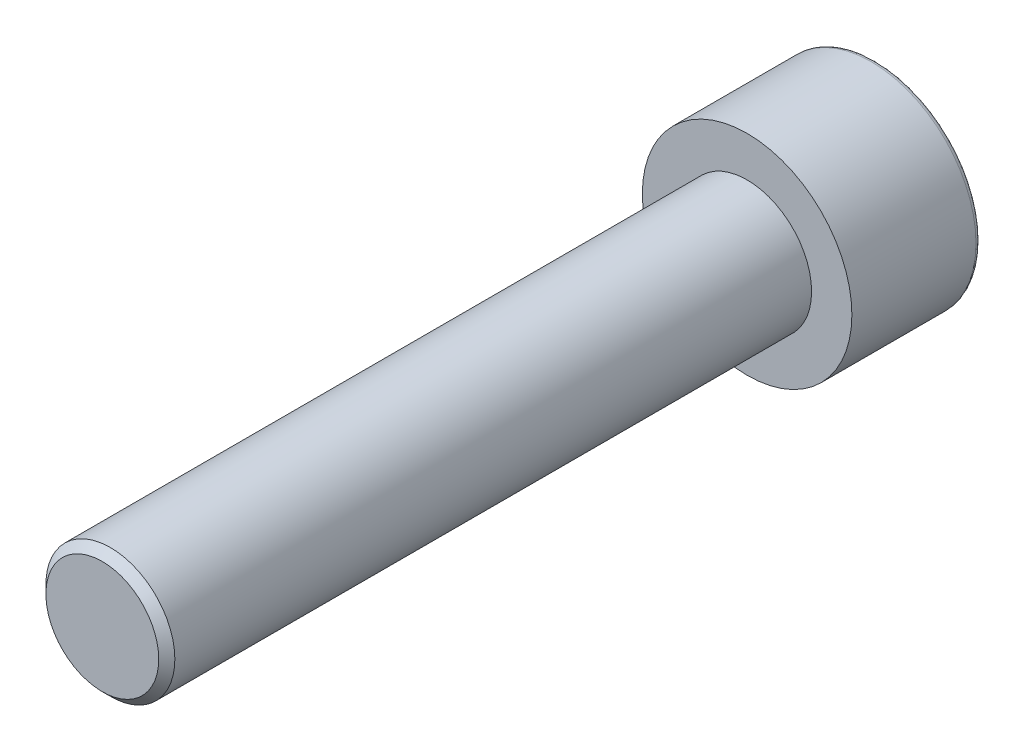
from build123d import *

# Parameters (mm, degrees)
ESQUISSE1_R             = 6.5
BASE_EXTRUSION_DEPTH    = 8
ESQUISSE2_R             = 4
BOSS_EXTRU_1_DEPTH      = 40
CHANFREIN1_SIZE         = 0.5
ENL_V_MAT_EXTRU_1_DEPTH = 6
CONG_1_R                = 0.3


with BuildPart() as part:
    # Esquisse1 → Base-Extrusion (new body)
    with BuildSketch(Plane.XY):
        Circle(ESQUISSE1_R)
    extrude(amount=BASE_EXTRUSION_DEPTH)

    # Esquisse2 → Boss.-Extru.1 (add)
    with BuildSketch(Plane.XY.offset(8)):
        Circle(ESQUISSE2_R)
    extrude(amount=BOSS_EXTRU_1_DEPTH)

    # Chanfrein1
    chanfrein1_edges = [part.edges().sort_by_distance(p)[0] for p in [
        (-4, 0, 48),
    ]]
    chamfer(chanfrein1_edges, length=CHANFREIN1_SIZE)

    # Esquisse3 → Enl_v. mat.-Extru.1 (cut)
    with BuildSketch(Plane(origin=(0, 0, 0), x_dir=(-1, 0, 0), z_dir=(0, 0, -1))):
        Polygon((1.732050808, 3), (-1.732050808, 3), (-3.464101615, 0), (-1.732050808, -3), (1.732050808, -3), (3.464101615, 0), align=None)
    extrude(amount=-ENL_V_MAT_EXTRU_1_DEPTH, mode=Mode.SUBTRACT)

    # Cong_1
    cong_1_edges = [part.edges().sort_by_distance(p)[0] for p in [
        (-6.5, 0, 0),
    ]]
    fillet(cong_1_edges, radius=CONG_1_R)


solid = part.part
